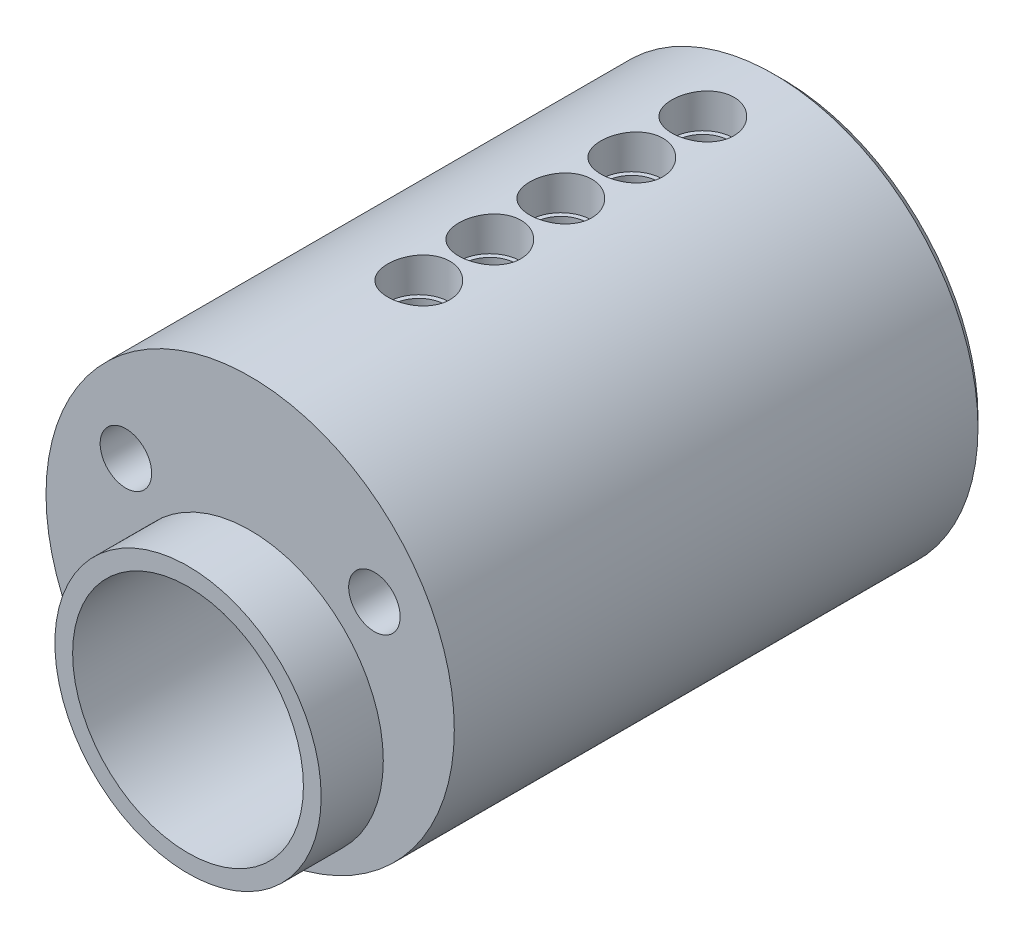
from build123d import *

# Parameters (mm, degrees)
ESQUISSE1_R                  = 11.5
BOSS_EXTRU_1_DEPTH           = 30
ESQUISSE2_R                  = 6.5
ENL_V_MAT_EXTRU_1_DEPTH      = 35.124771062
ESQUISSE3_R                  = 7
ENL_V_MAT_EXTRU_2_DEPTH      = 1
ESQUISSE4_R                  = 7.5
ESQUISSE4_R_2                = 6.5
BOSS_EXTRU_2_DEPTH           = 3.5
ENL_V_MAT_EXTRU_3_REACH      = 44.232
ENL_V_MAT_EXTRU_3_END_RADIUS = 6.5
ESQUISSE7_R                  = 1.5
ESQUISSE8_R                  = 1.75
ENL_V_MAT_EXTRU_4_DEPTH      = 2
CHANFREIN1_SIZE              = 0.5
TROU_TARAUD_M3_5X0_61_D      = 2.9
TROU_TARAUD_M3_5X0_61_DEPTH  = 10
TROU_TARAUD_M3_5X0_61_TIP    = 0.871247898
ENL_V_MAT_EXTRU_6_DEPTH      = 0.01
ESQUISSE15_W                 = 0.179487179
ESQUISSE15_H                 = 2.051282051
ESQUISSE15_H_2               = 2
ENL_V_MAT_EXTRU_7_DEPTH      = 0.01


with BuildPart() as part:
    # Esquisse1 → Boss.-Extru.1 (new body)
    with BuildSketch(Plane.XY):
        Circle(ESQUISSE1_R)
    extrude(amount=BOSS_EXTRU_1_DEPTH)

    # Esquisse2 → Enl_v. mat.-Extru.1 (cut, through all)
    with BuildSketch(Plane(origin=(0, 0, 0), x_dir=(-1, 0, 0), z_dir=(0, 0, -1))):
        with Locations((0, -3.5)):
            Circle(ESQUISSE2_R)
    extrude(amount=-ENL_V_MAT_EXTRU_1_DEPTH, mode=Mode.SUBTRACT)

    # Esquisse3 → Enl_v. mat.-Extru.2 (cut)
    with BuildSketch(Plane(origin=(0, 0, 0), x_dir=(-1, 0, 0), z_dir=(0, 0, -1))):
        with Locations((0, -3.5)):
            Circle(ESQUISSE3_R)
    extrude(amount=-ENL_V_MAT_EXTRU_2_DEPTH, mode=Mode.SUBTRACT)

    # Esquisse4 → Boss.-Extru.2 (add)
    with BuildSketch(Plane.XY.offset(30)):
        with Locations((0, -3.5)):
            Circle(ESQUISSE4_R)
        with Locations(Location((0, -3.5, 0), (0, 0, 180))):
            Circle(ESQUISSE4_R_2, mode=Mode.SUBTRACT)
    extrude(amount=BOSS_EXTRU_2_DEPTH)

    # Enl_v. mat.-Extru.3: up to this cylinder (the profile starts outside it)
    enl_v_mat_extru_3_end = Plane(origin=(0, -3.5, 12.5), z_dir=(0, 0, -1)) * Cylinder(ENL_V_MAT_EXTRU_3_END_RADIUS, 118.464, mode=Mode.PRIVATE)
    # Esquisse7 → Enl_v. mat.-Extru.3 (cut, up to the surface)
    with BuildSketch(Plane(origin=(0, 11.5, 0), x_dir=(-1, 0, 0), z_dir=(0, 1, 0)), mode=Mode.PRIVATE) as enl_v_mat_extru_3_sk1:
        with Locations(Location((0, 4.5, 0), (0, 0, 90))):
            Circle(ESQUISSE7_R)
    enl_v_mat_extru_3_tool1 = extrude(enl_v_mat_extru_3_sk1.sketch, amount=-ENL_V_MAT_EXTRU_3_REACH, mode=Mode.PRIVATE) - enl_v_mat_extru_3_end
    add(enl_v_mat_extru_3_tool1.solids().sort_by_distance((0, 11.5, 4.5))[0], mode=Mode.SUBTRACT)
    # Esquisse7 → Enl_v. mat.-Extru.3 (cut, up to the surface)
    with BuildSketch(Plane(origin=(0, 11.5, 0), x_dir=(-1, 0, 0), z_dir=(0, 1, 0)), mode=Mode.PRIVATE) as enl_v_mat_extru_3_sk2:
        with Locations(Location((0, 8.5, 0), (0, 0, 90))):
            Circle(ESQUISSE7_R)
    enl_v_mat_extru_3_tool2 = extrude(enl_v_mat_extru_3_sk2.sketch, amount=-ENL_V_MAT_EXTRU_3_REACH, mode=Mode.PRIVATE) - enl_v_mat_extru_3_end
    add(enl_v_mat_extru_3_tool2.solids().sort_by_distance((0, 11.5, 8.5))[0], mode=Mode.SUBTRACT)
    # Esquisse7 → Enl_v. mat.-Extru.3 (cut, up to the surface)
    with BuildSketch(Plane(origin=(0, 11.5, 0), x_dir=(-1, 0, 0), z_dir=(0, 1, 0)), mode=Mode.PRIVATE) as enl_v_mat_extru_3_sk3:
        with Locations(Location((0, 12.5, 0), (0, 0, 90))):
            Circle(ESQUISSE7_R)
    enl_v_mat_extru_3_tool3 = extrude(enl_v_mat_extru_3_sk3.sketch, amount=-ENL_V_MAT_EXTRU_3_REACH, mode=Mode.PRIVATE) - enl_v_mat_extru_3_end
    add(enl_v_mat_extru_3_tool3.solids().sort_by_distance((0, 11.5, 12.5))[0], mode=Mode.SUBTRACT)
    # Esquisse7 → Enl_v. mat.-Extru.3 (cut, up to the surface)
    with BuildSketch(Plane(origin=(0, 11.5, 0), x_dir=(-1, 0, 0), z_dir=(0, 1, 0)), mode=Mode.PRIVATE) as enl_v_mat_extru_3_sk4:
        with Locations(Location((0, 16.5, 0), (0, 0, 90))):
            Circle(ESQUISSE7_R)
    enl_v_mat_extru_3_tool4 = extrude(enl_v_mat_extru_3_sk4.sketch, amount=-ENL_V_MAT_EXTRU_3_REACH, mode=Mode.PRIVATE) - enl_v_mat_extru_3_end
    add(enl_v_mat_extru_3_tool4.solids().sort_by_distance((0, 11.5, 16.5))[0], mode=Mode.SUBTRACT)
    # Esquisse7 → Enl_v. mat.-Extru.3 (cut, up to the surface)
    with BuildSketch(Plane(origin=(0, 11.5, 0), x_dir=(-1, 0, 0), z_dir=(0, 1, 0)), mode=Mode.PRIVATE) as enl_v_mat_extru_3_sk5:
        with Locations(Location((0, 20.5, 0), (0, 0, 90))):
            Circle(ESQUISSE7_R)
    enl_v_mat_extru_3_tool5 = extrude(enl_v_mat_extru_3_sk5.sketch, amount=-ENL_V_MAT_EXTRU_3_REACH, mode=Mode.PRIVATE) - enl_v_mat_extru_3_end
    add(enl_v_mat_extru_3_tool5.solids().sort_by_distance((0, 11.5, 20.5))[0], mode=Mode.SUBTRACT)

    # Esquisse8 → Enl_v. mat.-Extru.4 (cut)
    with BuildSketch(Plane(origin=(0, 11.5, 0), x_dir=(-1, 0, 0), z_dir=(0, 1, 0))):
        with Locations(Location((0, 20.5, 0), (0, 0, 90))):
            Circle(ESQUISSE8_R)
        with Locations(Location((0, 16.5, 0), (0, 0, 90))):
            Circle(ESQUISSE8_R)
        with Locations(Location((0, 12.5, 0), (0, 0, 90))):
            Circle(ESQUISSE8_R)
        with Locations(Location((0, 8.5, 0), (0, 0, 90))):
            Circle(ESQUISSE8_R)
        with Locations(Location((0, 4.5, 0), (0, 0, 90))):
            Circle(ESQUISSE8_R)
    extrude(amount=-ENL_V_MAT_EXTRU_4_DEPTH, mode=Mode.SUBTRACT)

    # Chanfrein1
    chanfrein1_edges = [part.edges().sort_by_distance(p)[0] for p in [
        (-11.5, 0, 0),
    ]]
    chamfer(chanfrein1_edges, length=CHANFREIN1_SIZE)

    # Trou taraud_ M3.5x0.61
    with Locations(Plane.XY.offset(30)):
        with Locations((-7, 4), (7, 4), (0, -3.5)):
            Hole(TROU_TARAUD_M3_5X0_61_D / 2, depth=TROU_TARAUD_M3_5X0_61_DEPTH)
            with Locations((0, 0, -(TROU_TARAUD_M3_5X0_61_DEPTH + TROU_TARAUD_M3_5X0_61_TIP / 2))):  # 118° drill point
                Cone(0, TROU_TARAUD_M3_5X0_61_D / 2, TROU_TARAUD_M3_5X0_61_TIP, mode=Mode.SUBTRACT)

    # Esquisse14 → Enl_v. mat.-Extru.6 (cut)
    with BuildSketch(Plane(origin=(-8.163719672, -2.261382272, 0), x_dir=(-1, 0, 0), z_dir=(0, 0, -1))):
        with BuildLine():
            Line((-13.566697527, 5.311729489), (-15.097949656, 6.842981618))
            ThreePointArc((-15.097949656, 6.842981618), (-15.791595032, 8.626687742), (-14.945128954, 10.343151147))
            ThreePointArc((-14.945128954, 10.343151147), (-8.163719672, 12.811382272), (-1.38231039, 10.343151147))
            ThreePointArc((-1.38231039, 10.343151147), (-0.535844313, 8.626687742), (-1.229489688, 6.842981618))
            Line((-1.229489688, 6.842981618), (-2.760741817, 5.311729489))
            ThreePointArc((-2.760741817, 5.311729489), (-3.495476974, 4.954542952), (-4.293920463, 5.127476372))
            ThreePointArc((-4.293920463, 5.127476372), (-8.163719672, 6.211382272), (-12.033518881, 5.127476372))
            ThreePointArc((-12.033518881, 5.127476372), (-12.83196237, 4.954542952), (-13.566697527, 5.311729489))
        make_face()
        with BuildLine():
            Line((-2.937518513, 5.488506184), (-1.406266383, 7.019758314))
            ThreePointArc((-1.406266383, 7.019758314), (-0.785606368, 8.615782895), (-1.543007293, 10.151640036))
            ThreePointArc((-1.543007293, 10.151640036), (-8.163719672, 12.561382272), (-14.784432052, 10.151640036))
            ThreePointArc((-14.784432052, 10.151640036), (-15.541832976, 8.615782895), (-14.921172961, 7.019758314))
            Line((-14.921172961, 7.019758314), (-13.389920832, 5.488506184))
            ThreePointArc((-13.389920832, 5.488506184), (-12.802132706, 5.202756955), (-12.163377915, 5.34110369))
            ThreePointArc((-12.163377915, 5.34110369), (-8.163719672, 6.461382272), (-4.164061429, 5.34110369))
            ThreePointArc((-4.164061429, 5.34110369), (-3.525306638, 5.202756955), (-2.937518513, 5.488506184))
        make_face(mode=Mode.SUBTRACT)
    extrude(amount=-ENL_V_MAT_EXTRU_6_DEPTH, mode=Mode.SUBTRACT)

    # Esquisse15 → Enl_v. mat.-Extru.7 (cut)
    # profile 1 of 16: a face of its own
    with BuildSketch(Plane(origin=(0, 0, 0), x_dir=(-1, 0, 0), z_dir=(0, 0, -1))):
        with BuildLine():
            Line((-2.012820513, 8.779246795), (-2.134615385, 8.653846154))
            add(Edge.make_bspline(
                [(-2.134615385, 8.653846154), (-2.145124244, 8.666025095), (-2.165384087, 8.689504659), (-2.197516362, 8.720897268), (-2.22952985, 8.747261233), (-2.260986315, 8.769519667), (-2.292676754, 8.786347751), (-2.324229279, 8.798630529), (-2.355676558, 8.806231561), (-2.376697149, 8.80721124), (-2.387019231, 8.807692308)],
                knots=[0, 0, 0, 0, 1.26578478, 2.440284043, 3.530471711, 4.527705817, 5.468200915, 6.346673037, 7.188140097, 8, 8, 8, 8], degree=3))
            add(Edge.make_bspline(
                [(-2.387019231, 8.807692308), (-2.399670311, 8.807078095), (-2.424565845, 8.80586941), (-2.460237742, 8.793804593), (-2.493352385, 8.775285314), (-2.522013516, 8.749017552), (-2.54629219, 8.718866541), (-2.564014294, 8.685154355), (-2.574851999, 8.64889833), (-2.576226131, 8.623738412), (-2.576923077, 8.610977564)],
                knots=[0, 0, 0, 0, 0.99966794, 1.967205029, 2.953328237, 3.988086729, 5.028030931, 6.008226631, 6.989793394, 8, 8, 8, 8], degree=3))
            add(Edge.make_bspline(
                [(-2.576923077, 8.610977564), (-2.576288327, 8.599427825), (-2.575020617, 8.576360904), (-2.565165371, 8.542333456), (-2.549470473, 8.509158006), (-2.534801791, 8.488836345), (-2.52724359, 8.478365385)],
                knots=[0, 0, 0, 0, 0.960159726, 1.917612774, 2.927026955, 4, 4, 4, 4], degree=3))
            add(Edge.make_bspline(
                [(-2.52724359, 8.478365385), (-2.522693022, 8.472774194), (-2.513007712, 8.460874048), (-2.494831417, 8.44435756), (-2.47424713, 8.426104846), (-2.44949288, 8.407855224), (-2.42163515, 8.388637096), (-2.390069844, 8.369207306), (-2.355798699, 8.348084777), (-2.331263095, 8.334687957), (-2.318509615, 8.327724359)],
                knots=[0, 0, 0, 0, 0.66740084, 1.420478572, 2.27185888, 3.217733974, 4.268547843, 5.408967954, 6.65319498, 8, 8, 8, 8], degree=3))
            add(Edge.make_bspline(
                [(-2.318509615, 8.327724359), (-2.302959, 8.319012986), (-2.272920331, 8.302185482), (-2.23023875, 8.276065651), (-2.191503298, 8.250104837), (-2.156385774, 8.224580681), (-2.125561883, 8.198779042), (-2.098096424, 8.173688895), (-2.074674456, 8.148552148), (-2.061557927, 8.130990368), (-2.055288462, 8.122596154)],
                knots=[0, 0, 0, 0, 1.27191281, 2.456916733, 3.569705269, 4.599008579, 5.553216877, 6.436649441, 7.252746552, 8, 8, 8, 8], degree=3))
            add(Edge.make_bspline(
                [(-2.055288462, 8.122596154), (-2.044882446, 8.105644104), (-2.024172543, 8.071906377), (-2.002424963, 8.01635299), (-1.989819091, 7.957432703), (-1.988069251, 7.917128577), (-1.987179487, 7.896634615)],
                knots=[0, 0, 0, 0, 0.995354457, 1.980940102, 2.973342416, 4, 4, 4, 4], degree=3))
            add(Edge.make_bspline(
                [(-1.987179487, 7.896634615), (-1.987590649, 7.882195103), (-1.988400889, 7.853740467), (-1.99403407, 7.81183485), (-2.003722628, 7.77175796), (-2.016919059, 7.73307494), (-2.034738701, 7.696526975), (-2.055623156, 7.661191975), (-2.080694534, 7.627834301), (-2.109318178, 7.596497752), (-2.14065846, 7.567877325), (-2.174090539, 7.54272078), (-2.209655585, 7.521821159), (-2.247099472, 7.504526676), (-2.286507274, 7.490773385), (-2.327885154, 7.481251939), (-2.371101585, 7.475553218), (-2.400490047, 7.474762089), (-2.415464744, 7.474358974)],
                knots=[0, 0, 0, 0, 1.032770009, 2.035186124, 3.017557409, 3.978232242, 4.952395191, 5.920591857, 6.910227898, 7.931268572, 8.952309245, 9.941945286, 10.918353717, 11.897095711, 12.887975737, 13.898235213, 14.929059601, 16, 16, 16, 16], degree=3))
            add(Edge.make_bspline(
                [(-2.415464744, 7.474358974), (-2.435674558, 7.474926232), (-2.475813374, 7.476052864), (-2.535178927, 7.486627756), (-2.593190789, 7.503082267), (-2.649409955, 7.525777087), (-2.702579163, 7.554434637), (-2.751225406, 7.588756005), (-2.79551767, 7.627607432), (-2.820728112, 7.657386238), (-2.833333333, 7.672275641)],
                knots=[0, 0, 0, 0, 1.013940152, 2.01379169, 3.017749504, 4.037548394, 5.051665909, 6.043208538, 7.021604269, 8, 8, 8, 8], degree=3))
            Line((-2.833333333, 7.672275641), (-2.714342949, 7.807692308))
            add(Edge.make_bspline(
                [(-2.714342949, 7.807692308), (-2.703044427, 7.795489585), (-2.681140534, 7.771832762), (-2.646111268, 7.740333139), (-2.610465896, 7.713932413), (-2.57456036, 7.691850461), (-2.537863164, 7.674835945), (-2.500579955, 7.662882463), (-2.46278657, 7.655200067), (-2.437402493, 7.654298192), (-2.424679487, 7.653846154)],
                knots=[0, 0, 0, 0, 1.179806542, 2.287233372, 3.337373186, 4.324005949, 5.273901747, 6.200048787, 7.097828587, 8, 8, 8, 8], degree=3))
            add(Edge.make_bspline(
                [(-2.424679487, 7.653846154), (-2.407354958, 7.654629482), (-2.373505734, 7.656159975), (-2.325023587, 7.670055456), (-2.280258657, 7.691844), (-2.241388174, 7.722749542), (-2.208301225, 7.758724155), (-2.184342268, 7.799246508), (-2.169327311, 7.843127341), (-2.167563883, 7.8735458), (-2.166666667, 7.889022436)],
                knots=[0, 0, 0, 0, 1.072336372, 2.095165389, 3.102688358, 4.141489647, 5.156069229, 6.117746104, 7.042326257, 8, 8, 8, 8], degree=3))
            add(Edge.make_bspline(
                [(-2.166666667, 7.889022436), (-2.167287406, 7.901770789), (-2.168512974, 7.926940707), (-2.1781377, 7.963369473), (-2.193345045, 7.997923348), (-2.208319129, 8.018146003), (-2.215945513, 8.028445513)],
                knots=[0, 0, 0, 0, 1.013901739, 2.00181326, 2.98231254, 4, 4, 4, 4], degree=3))
            add(Edge.make_bspline(
                [(-2.215945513, 8.028445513), (-2.220529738, 8.033608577), (-2.230515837, 8.044855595), (-2.248833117, 8.061098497), (-2.27076561, 8.078605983), (-2.296559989, 8.097081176), (-2.326268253, 8.116280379), (-2.36001081, 8.136102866), (-2.397325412, 8.157490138), (-2.42370863, 8.171672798), (-2.4375, 8.179086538)],
                knots=[0, 0, 0, 0, 0.615000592, 1.339693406, 2.178160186, 3.116406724, 4.166410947, 5.330106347, 6.604359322, 8, 8, 8, 8], degree=3))
            add(Edge.make_bspline(
                [(-2.4375, 8.179086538), (-2.452383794, 8.187394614), (-2.481248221, 8.203506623), (-2.522132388, 8.228601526), (-2.55901659, 8.254125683), (-2.592788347, 8.278647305), (-2.622594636, 8.303459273), (-2.648318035, 8.328589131), (-2.670971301, 8.353023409), (-2.683512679, 8.37033615), (-2.689503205, 8.378605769)],
                knots=[0, 0, 0, 0, 1.262093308, 2.447601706, 3.550203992, 4.582594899, 5.537233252, 6.418365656, 7.244515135, 8, 8, 8, 8], degree=3))
            add(Edge.make_bspline(
                [(-2.689503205, 8.378605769), (-2.699863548, 8.395260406), (-2.720587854, 8.428575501), (-2.74071082, 8.484181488), (-2.754542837, 8.54272152), (-2.755778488, 8.583114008), (-2.756410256, 8.603766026)],
                knots=[0, 0, 0, 0, 0.985009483, 1.970363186, 2.962279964, 4, 4, 4, 4], degree=3))
            add(Edge.make_bspline(
                [(-2.756410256, 8.603766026), (-2.756105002, 8.617266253), (-2.755507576, 8.643688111), (-2.750739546, 8.682510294), (-2.742058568, 8.719394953), (-2.731170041, 8.754896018), (-2.716036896, 8.788325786), (-2.697953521, 8.820130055), (-2.676703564, 8.850264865), (-2.652221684, 8.878266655), (-2.625303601, 8.903700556), (-2.596220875, 8.9258712), (-2.565627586, 8.944789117), (-2.533394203, 8.960654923), (-2.499211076, 8.972655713), (-2.463317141, 8.980917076), (-2.425785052, 8.986434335), (-2.400127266, 8.986927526), (-2.387019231, 8.987179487)],
                knots=[0, 0, 0, 0, 1.087655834, 2.128696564, 3.144119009, 4.137814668, 5.115653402, 6.093965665, 7.082169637, 8.081268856, 9.086088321, 10.061021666, 11.022561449, 11.980240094, 12.950172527, 13.934149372, 14.944599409, 16, 16, 16, 16], degree=3))
            add(Edge.make_bspline(
                [(-2.387019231, 8.987179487), (-2.371480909, 8.986548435), (-2.340112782, 8.985274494), (-2.293052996, 8.975156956), (-2.246062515, 8.958509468), (-2.1990206, 8.935517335), (-2.152271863, 8.905764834), (-2.105405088, 8.869805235), (-2.057857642, 8.827875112), (-2.028168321, 8.795818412), (-2.012820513, 8.779246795)],
                knots=[0, 0, 0, 0, 0.845714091, 1.707292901, 2.609013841, 3.555613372, 4.552488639, 5.621697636, 6.770543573, 8, 8, 8, 8], degree=3))
        make_face()
    # profile 2 of 16: a face of its own
    with BuildSketch(Plane(origin=(0, 0, 0), x_dir=(-1, 0, 0), z_dir=(0, 0, -1))):
        Polygon((-1.448717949, 9.551282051), (-1.269230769, 9.551282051), (-1.269230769, 8.961538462), (-1.012820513, 8.961538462), (-1.012820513, 8.782051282), (-1.269230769, 8.782051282), (-1.269230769, 7.5), (-1.448717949, 7.5), (-1.448717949, 8.782051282), (-1.705128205, 8.782051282), (-1.705128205, 8.961538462), (-1.448717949, 8.961538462), align=None)
    # profile 3 of 16: a face of its own
    with BuildSketch(Plane(origin=(0, 0, 0), x_dir=(-1, 0, 0), z_dir=(0, 0, -1))):
        Polygon((-0.858974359, 8.961538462), (-0.665464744, 8.961538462), (-0.170673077, 7.842147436), (0.331730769, 8.961538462), (0.525641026, 8.961538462), (-0.371794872, 6.961538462), (-0.565705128, 6.961538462), (-0.268028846, 7.624599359), align=None)
    # profile 4 of 16: a face of its own
    with BuildSketch(Plane(origin=(0, 0, 0), x_dir=(-1, 0, 0), z_dir=(0, 0, -1))):
        with Locations((0.820512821, 8.525641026)):
            Rectangle(ESQUISSE15_W, ESQUISSE15_H)
    # profile 5 of 16: a face of its own
    with BuildSketch(Plane(origin=(0, 0, 0), x_dir=(-1, 0, 0), z_dir=(0, 0, -1))):
        with BuildLine():
            Line((2.520032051, 7.961538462), (2.679487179, 7.877804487))
            add(Edge.make_bspline(
                [(2.679487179, 7.877804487), (2.666780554, 7.855265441), (2.642058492, 7.811413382), (2.599543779, 7.751166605), (2.55497688, 7.69696791), (2.506346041, 7.65026525), (2.455106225, 7.609550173), (2.400973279, 7.573928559), (2.343665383, 7.543575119), (2.283179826, 7.518002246), (2.219008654, 7.498339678), (2.150996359, 7.484451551), (2.079012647, 7.475866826), (2.029671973, 7.474869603), (2.004407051, 7.474358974)],
                knots=[0, 0, 0, 0, 1.120438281, 2.179929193, 3.190490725, 4.156257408, 5.095198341, 6.022838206, 6.959905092, 7.901321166, 8.864066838, 9.862729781, 10.905609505, 12, 12, 12, 12], degree=3))
            add(Edge.make_bspline(
                [(2.004407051, 7.474358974), (1.976325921, 7.475014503), (1.921547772, 7.47629325), (1.841810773, 7.487317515), (1.76673682, 7.50530172), (1.696330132, 7.530424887), (1.630763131, 7.563240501), (1.5699055, 7.603217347), (1.513437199, 7.650150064), (1.463137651, 7.704445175), (1.417855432, 7.76254915), (1.377897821, 7.82309537), (1.344493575, 7.885931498), (1.317320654, 7.950657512), (1.295375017, 8.016865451), (1.280079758, 8.085157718), (1.271262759, 8.155349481), (1.269911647, 8.202833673), (1.269230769, 8.226762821)],
                knots=[0, 0, 0, 0, 1.145258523, 2.234067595, 3.276747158, 4.290159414, 5.277019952, 6.260822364, 7.254936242, 8.264827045, 9.274100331, 10.257902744, 11.220704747, 12.172965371, 13.118907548, 14.062713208, 15.023725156, 16, 16, 16, 16], degree=3))
            add(Edge.make_bspline(
                [(1.269230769, 8.226762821), (1.269835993, 8.249217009), (1.271035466, 8.293718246), (1.278595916, 8.359584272), (1.291994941, 8.42360053), (1.310381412, 8.485820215), (1.334124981, 8.546139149), (1.363171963, 8.604594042), (1.397567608, 8.661122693), (1.424123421, 8.696781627), (1.4375, 8.71474359)],
                knots=[0, 0, 0, 0, 1.024358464, 2.0301432, 3.019427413, 4.004406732, 4.986367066, 5.972626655, 6.978780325, 8, 8, 8, 8], degree=3))
            add(Edge.make_bspline(
                [(1.4375, 8.71474359), (1.455618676, 8.736382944), (1.491282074, 8.778976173), (1.551599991, 8.83494093), (1.616914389, 8.881823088), (1.686406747, 8.920684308), (1.760884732, 8.950212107), (1.839347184, 8.972216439), (1.922687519, 8.984546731), (1.979661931, 8.986288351), (2.008814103, 8.987179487)],
                knots=[0, 0, 0, 0, 1.030682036, 2.02871468, 2.997146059, 3.962720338, 4.930598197, 5.918074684, 6.934738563, 8, 8, 8, 8], degree=3))
            add(Edge.make_bspline(
                [(2.008814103, 8.987179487), (2.038784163, 8.986405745), (2.097578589, 8.984887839), (2.18331123, 8.970815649), (2.264431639, 8.948499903), (2.340907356, 8.916983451), (2.412746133, 8.87632085), (2.479481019, 8.825954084), (2.542253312, 8.767429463), (2.5787725, 8.722421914), (2.597355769, 8.699519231)],
                knots=[0, 0, 0, 0, 1.056321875, 2.072262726, 3.055038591, 4.01806755, 4.982017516, 5.957941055, 6.960871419, 8, 8, 8, 8], degree=3))
            add(Edge.make_bspline(
                [(2.597355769, 8.699519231), (2.609999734, 8.682260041), (2.635203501, 8.647856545), (2.666773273, 8.591758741), (2.694177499, 8.533066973), (2.716082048, 8.470832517), (2.733818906, 8.405792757), (2.746651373, 8.337482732), (2.75417687, 8.265922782), (2.755656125, 8.217164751), (2.756410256, 8.192307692)],
                knots=[0, 0, 0, 0, 0.94817472, 1.890038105, 2.849395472, 3.817997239, 4.812318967, 5.836947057, 6.897266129, 8, 8, 8, 8], degree=3))
            Line((2.756410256, 8.192307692), (1.448717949, 8.192307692))
            add(Edge.make_bspline(
                [(1.448717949, 8.192307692), (1.449597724, 8.173050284), (1.451327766, 8.135181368), (1.459393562, 8.079769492), (1.472107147, 8.026984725), (1.489975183, 7.977222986), (1.51161338, 7.929834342), (1.538119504, 7.885170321), (1.569742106, 7.843434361), (1.605013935, 7.80425314), (1.644275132, 7.769361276), (1.685579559, 7.73813169), (1.729518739, 7.711957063), (1.775746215, 7.690711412), (1.824187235, 7.674079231), (1.874857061, 7.662726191), (1.927655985, 7.65512213), (1.963647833, 7.654276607), (1.981971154, 7.653846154)],
                knots=[0, 0, 0, 0, 1.094153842, 2.151609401, 3.174256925, 4.172055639, 5.149267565, 6.128595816, 7.11444997, 8.118368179, 9.117203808, 10.09244225, 11.054858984, 12.015122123, 12.976791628, 13.957293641, 14.960065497, 16, 16, 16, 16], degree=3))
            add(Edge.make_bspline(
                [(1.981971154, 7.653846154), (1.999886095, 7.654193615), (2.035432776, 7.654883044), (2.088370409, 7.661586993), (2.140450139, 7.672427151), (2.191456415, 7.687221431), (2.240354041, 7.705265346), (2.285637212, 7.727038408), (2.32728305, 7.751123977), (2.366207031, 7.778672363), (2.403961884, 7.812391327), (2.441414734, 7.854468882), (2.481572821, 7.904233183), (2.506709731, 7.94168785), (2.520032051, 7.961538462)],
                knots=[0, 0, 0, 0, 0.99110716, 1.966546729, 2.947904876, 3.932708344, 4.903319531, 5.828989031, 6.710028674, 7.56322171, 8.463672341, 9.504779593, 10.677557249, 12, 12, 12, 12], degree=3))
        make_face()
        with BuildLine():
            add(Edge.make_bspline(
                [(2.576923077, 8.371794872), (2.570353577, 8.395602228), (2.557709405, 8.441423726), (2.531288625, 8.504875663), (2.501533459, 8.561268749), (2.466321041, 8.610171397), (2.426424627, 8.653601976), (2.380341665, 8.691555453), (2.328664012, 8.725508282), (2.271658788, 8.754166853), (2.211292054, 8.778561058), (2.148088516, 8.794918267), (2.083598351, 8.80612372), (2.039978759, 8.80716721), (2.018028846, 8.807692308)],
                knots=[0, 0, 0, 0, 1.154881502, 2.222775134, 3.210006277, 4.132804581, 5.035138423, 5.962687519, 6.919655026, 7.923214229, 8.944639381, 9.960483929, 10.97369054, 12, 12, 12, 12], degree=3))
            add(Edge.make_bspline(
                [(2.018028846, 8.807692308), (2.000114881, 8.807342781), (1.964702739, 8.80665184), (1.9125307, 8.800097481), (1.862428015, 8.789263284), (1.814024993, 8.774426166), (1.767955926, 8.754649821), (1.723273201, 8.731459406), (1.681112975, 8.70314993), (1.65474652, 8.681573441), (1.641426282, 8.670673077)],
                knots=[0, 0, 0, 0, 1.04873581, 2.073130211, 3.073294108, 4.04793562, 5.032784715, 6.005352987, 6.992311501, 8, 8, 8, 8], degree=3))
            add(Edge.make_bspline(
                [(1.641426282, 8.670673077), (1.631887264, 8.662047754), (1.612582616, 8.644592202), (1.586788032, 8.614518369), (1.562090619, 8.582088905), (1.539614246, 8.54606312), (1.518998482, 8.506851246), (1.499707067, 8.464784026), (1.482343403, 8.419542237), (1.472574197, 8.388015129), (1.467548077, 8.371794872)],
                knots=[0, 0, 0, 0, 0.879870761, 1.780643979, 2.707998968, 3.669668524, 4.684282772, 5.740141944, 6.837334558, 8, 8, 8, 8], degree=3))
            Line((1.467548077, 8.371794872), (2.576923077, 8.371794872))
        make_face(mode=Mode.SUBTRACT)
    # profile 6 of 16: a face of its own
    with BuildSketch(Plane(origin=(0, 0, 0), x_dir=(-1, 0, 0), z_dir=(0, 0, -1))):
        Polygon((-5.707532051, 5.935897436), (-5.83213141, 5.935897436), (-5.858974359, 6.551282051), (-5.679487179, 6.551282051), align=None)
    # profile 7 of 16: a face of its own
    with BuildSketch(Plane(origin=(0, 0, 0), x_dir=(-1, 0, 0), z_dir=(0, 0, -1))):
        Polygon((-6.244791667, 5.935897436), (-6.370592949, 5.935897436), (-6.397435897, 6.551282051), (-6.217948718, 6.551282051), align=None)
    # profile 8 of 16: a face of its own
    with BuildSketch(Plane(origin=(0, 0, 0), x_dir=(-1, 0, 0), z_dir=(0, 0, -1))):
        Polygon((-5.602564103, 6.294871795), (-5.602564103, 6.5), (-4.551282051, 6.5), (-4.551282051, 6.294871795), (-4.987179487, 6.294871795), (-4.987179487, 4.5), (-5.166666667, 4.5), (-5.166666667, 6.294871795), align=None)
    # profile 9 of 16: a face of its own
    with BuildSketch(Plane(origin=(0, 0, 0), x_dir=(-1, 0, 0), z_dir=(0, 0, -1))):
        Polygon((-4.243589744, 6.5), (-4.064102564, 6.5), (-4.064102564, 5.679487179), (-3.038461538, 5.679487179), (-3.038461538, 6.5), (-2.858974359, 6.5), (-2.858974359, 4.5), (-3.038461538, 4.5), (-3.038461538, 5.474358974), (-4.064102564, 5.474358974), (-4.064102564, 4.5), (-4.243589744, 4.5), align=None)
    # profile 10 of 16: a face of its own
    with BuildSketch(Plane(origin=(0, 0, 0), x_dir=(-1, 0, 0), z_dir=(0, 0, -1))):
        with Locations((-2.256410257, 5.5)):
            Rectangle(ESQUISSE15_W, ESQUISSE15_H_2)
    # profile 11 of 16: a face of its own
    with BuildSketch(Plane(origin=(0, 0, 0), x_dir=(-1, 0, 0), z_dir=(0, 0, -1))):
        with BuildLine():
            Line((-1.653846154, 6.5), (-1.253605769, 6.5))
            add(Edge.make_bspline(
                [(-1.253605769, 6.5), (-1.226896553, 6.499911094), (-1.175611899, 6.499740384), (-1.102141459, 6.498788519), (-1.035383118, 6.496060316), (-0.975371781, 6.493712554), (-0.922108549, 6.489431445), (-0.875430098, 6.485339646), (-0.835551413, 6.479983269), (-0.811410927, 6.475008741), (-0.800480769, 6.47275641)],
                knots=[0, 0, 0, 0, 1.410062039, 2.707475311, 3.878576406, 4.937260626, 5.877586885, 6.699081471, 7.410979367, 8, 8, 8, 8], degree=3))
            add(Edge.make_bspline(
                [(-0.800480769, 6.47275641), (-0.785848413, 6.469141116), (-0.756895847, 6.461987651), (-0.715210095, 6.446867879), (-0.675487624, 6.429370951), (-0.637893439, 6.408820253), (-0.602615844, 6.385063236), (-0.569291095, 6.358510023), (-0.537767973, 6.329305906), (-0.509321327, 6.296714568), (-0.482499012, 6.262522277), (-0.45987694, 6.225548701), (-0.440376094, 6.186884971), (-0.424850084, 6.146137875), (-0.412348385, 6.103702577), (-0.403533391, 6.059194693), (-0.398246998, 6.012816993), (-0.397708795, 5.981183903), (-0.397435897, 5.965144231)],
                knots=[0, 0, 0, 0, 1.027469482, 2.033020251, 3.019912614, 3.986113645, 4.951240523, 5.91722682, 6.890402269, 7.87763091, 8.8651537, 9.85103654, 10.82876324, 11.815024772, 12.821070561, 13.842952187, 14.906261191, 16, 16, 16, 16], degree=3))
            add(Edge.make_bspline(
                [(-0.397435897, 5.965144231), (-0.398275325, 5.9384956), (-0.399913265, 5.886497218), (-0.415184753, 5.811033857), (-0.440199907, 5.740639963), (-0.474670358, 5.67540417), (-0.518567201, 5.616598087), (-0.571324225, 5.564946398), (-0.63297086, 5.521723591), (-0.690359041, 5.49175056), (-0.741052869, 5.472554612), (-0.782786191, 5.459048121), (-0.828310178, 5.448612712), (-0.877188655, 5.439264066), (-0.929625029, 5.432205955), (-0.985493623, 5.427036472), (-1.044834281, 5.423805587), (-1.085599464, 5.423324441), (-1.106570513, 5.423076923)],
                knots=[0, 0, 0, 0, 1.260483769, 2.459530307, 3.627416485, 4.787058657, 5.939039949, 7.08810263, 8.267026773, 9.491475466, 10.141966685, 10.831826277, 11.566392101, 12.351337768, 13.187381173, 14.07005841, 15.007169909, 16, 16, 16, 16], degree=3))
            Line((-1.106570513, 5.423076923), (-0.371794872, 4.5))
            Line((-0.371794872, 4.5), (-0.59375, 4.5))
            Line((-0.59375, 4.5), (-1.328525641, 5.423076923))
            Line((-1.328525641, 5.423076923), (-1.474358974, 5.423076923))
            Line((-1.474358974, 5.423076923), (-1.474358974, 4.5))
            Line((-1.474358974, 4.5), (-1.653846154, 4.5))
            Line((-1.653846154, 4.5), (-1.653846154, 6.5))
        make_face()
        with BuildLine():
            Line((-1.474358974, 6.294871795), (-1.474358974, 5.628205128))
            Line((-1.474358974, 5.628205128), (-1.108173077, 5.625400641))
            add(Edge.make_bspline(
                [(-1.108173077, 5.625400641), (-1.091075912, 5.625393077), (-1.057936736, 5.625378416), (-1.009993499, 5.627660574), (-0.965353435, 5.630256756), (-0.924187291, 5.634227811), (-0.886476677, 5.639345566), (-0.852240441, 5.645747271), (-0.821422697, 5.653205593), (-0.785480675, 5.664749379), (-0.745345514, 5.683038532), (-0.701727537, 5.709647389), (-0.664583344, 5.743115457), (-0.633201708, 5.781386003), (-0.60798489, 5.82346386), (-0.590206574, 5.868844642), (-0.578925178, 5.916382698), (-0.577594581, 5.949055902), (-0.576923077, 5.965544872)],
                knots=[0, 0, 0, 0, 1.146690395, 2.22261258, 3.21895312, 4.145990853, 4.996080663, 5.770904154, 6.481378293, 7.121626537, 8.300444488, 9.431385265, 10.535395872, 11.636531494, 12.74115979, 13.810798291, 14.895190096, 16, 16, 16, 16], degree=3))
            add(Edge.make_bspline(
                [(-0.576923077, 5.965544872), (-0.577610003, 5.981628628), (-0.578971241, 6.013500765), (-0.590084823, 6.060161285), (-0.608878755, 6.104199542), (-0.634205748, 6.145436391), (-0.665062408, 6.18286824), (-0.701244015, 6.214895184), (-0.74176127, 6.24132345), (-0.779630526, 6.258211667), (-0.813478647, 6.268565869), (-0.842867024, 6.275852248), (-0.876073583, 6.281706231), (-0.913259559, 6.286396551), (-0.954266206, 6.290427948), (-0.999300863, 6.29314325), (-1.048064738, 6.294751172), (-1.081862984, 6.294830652), (-1.099358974, 6.294871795)],
                knots=[0, 0, 0, 0, 1.101028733, 2.181837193, 3.264309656, 4.369019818, 5.486613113, 6.575447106, 7.666700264, 8.788928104, 9.402425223, 10.0903467, 10.862060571, 11.710948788, 12.657782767, 13.684531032, 14.801375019, 16, 16, 16, 16], degree=3))
            Line((-1.099358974, 6.294871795), (-1.474358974, 6.294871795))
        make_face(mode=Mode.SUBTRACT)
    # profile 12 of 16: a face of its own
    with BuildSketch(Plane(origin=(0, 0, 0), x_dir=(-1, 0, 0), z_dir=(0, 0, -1))):
        Polygon((0.858974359, 6.5), (1.782051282, 4.5), (1.586939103, 4.5), (1.291266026, 5.141025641), (0.384615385, 5.141025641), (0.080528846, 4.5), (-0.115384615, 4.5), (0.833333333, 6.5), align=None)
        Polygon((0.844150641, 6.110176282), (0.481971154, 5.346153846), (1.196714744, 5.346153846), align=None, mode=Mode.SUBTRACT)
    # profile 13 of 16: a face of its own
    with BuildSketch(Plane(origin=(0, 0, 0), x_dir=(-1, 0, 0), z_dir=(0, 0, -1))):
        with BuildLine():
            Line((2.141025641, 6.5), (2.541266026, 6.5))
            add(Edge.make_bspline(
                [(2.541266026, 6.5), (2.567975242, 6.499911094), (2.619259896, 6.499740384), (2.692730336, 6.498788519), (2.759488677, 6.496060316), (2.819500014, 6.493712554), (2.872763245, 6.489431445), (2.919441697, 6.485339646), (2.959320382, 6.479983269), (2.983460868, 6.475008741), (2.994391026, 6.47275641)],
                knots=[0, 0, 0, 0, 1.410062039, 2.707475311, 3.878576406, 4.937260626, 5.877586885, 6.699081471, 7.410979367, 8, 8, 8, 8], degree=3))
            add(Edge.make_bspline(
                [(2.994391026, 6.47275641), (3.009023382, 6.469141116), (3.037975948, 6.461987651), (3.0796617, 6.446867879), (3.119384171, 6.429370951), (3.156978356, 6.408820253), (3.192255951, 6.385063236), (3.2255807, 6.358510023), (3.257103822, 6.329305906), (3.285550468, 6.296714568), (3.312372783, 6.262522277), (3.334994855, 6.225548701), (3.354495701, 6.186884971), (3.37002171, 6.146137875), (3.38252341, 6.103702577), (3.391338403, 6.059194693), (3.396624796, 6.012816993), (3.397163, 5.981183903), (3.397435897, 5.965144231)],
                knots=[0, 0, 0, 0, 1.027469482, 2.033020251, 3.019912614, 3.986113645, 4.951240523, 5.91722682, 6.890402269, 7.87763091, 8.8651537, 9.85103654, 10.82876324, 11.815024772, 12.821070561, 13.842952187, 14.906261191, 16, 16, 16, 16], degree=3))
            add(Edge.make_bspline(
                [(3.397435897, 5.965144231), (3.39659647, 5.9384956), (3.394958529, 5.886497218), (3.379687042, 5.811033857), (3.354671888, 5.740639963), (3.320201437, 5.67540417), (3.276304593, 5.616598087), (3.22354757, 5.564946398), (3.161900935, 5.521723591), (3.104512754, 5.49175056), (3.053818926, 5.472554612), (3.012085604, 5.459048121), (2.966561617, 5.448612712), (2.91768314, 5.439264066), (2.865246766, 5.432205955), (2.809378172, 5.427036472), (2.750037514, 5.423805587), (2.709272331, 5.423324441), (2.688301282, 5.423076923)],
                knots=[0, 0, 0, 0, 1.260483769, 2.459530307, 3.627416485, 4.787058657, 5.939039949, 7.08810263, 8.267026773, 9.491475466, 10.141966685, 10.831826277, 11.566392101, 12.351337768, 13.187381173, 14.07005841, 15.007169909, 16, 16, 16, 16], degree=3))
            Line((2.688301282, 5.423076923), (3.423076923, 4.5))
            Line((3.423076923, 4.5), (3.201121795, 4.5))
            Line((3.201121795, 4.5), (2.466346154, 5.423076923))
            Line((2.466346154, 5.423076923), (2.320512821, 5.423076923))
            Line((2.320512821, 5.423076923), (2.320512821, 4.5))
            Line((2.320512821, 4.5), (2.141025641, 4.5))
            Line((2.141025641, 4.5), (2.141025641, 6.5))
        make_face()
        with BuildLine():
            Line((2.320512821, 6.294871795), (2.320512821, 5.628205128))
            Line((2.320512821, 5.628205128), (2.686698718, 5.625400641))
            add(Edge.make_bspline(
                [(2.686698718, 5.625400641), (2.703795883, 5.625393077), (2.736935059, 5.625378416), (2.784878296, 5.627660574), (2.829518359, 5.630256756), (2.870684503, 5.634227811), (2.908395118, 5.639345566), (2.942631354, 5.645747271), (2.973449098, 5.653205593), (3.00939112, 5.664749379), (3.049526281, 5.683038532), (3.093144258, 5.709647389), (3.130288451, 5.743115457), (3.161670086, 5.781386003), (3.186886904, 5.82346386), (3.204665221, 5.868844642), (3.215946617, 5.916382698), (3.217277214, 5.949055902), (3.217948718, 5.965544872)],
                knots=[0, 0, 0, 0, 1.146690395, 2.22261258, 3.21895312, 4.145990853, 4.996080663, 5.770904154, 6.481378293, 7.121626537, 8.300444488, 9.431385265, 10.535395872, 11.636531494, 12.74115979, 13.810798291, 14.895190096, 16, 16, 16, 16], degree=3))
            add(Edge.make_bspline(
                [(3.217948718, 5.965544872), (3.217261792, 5.981628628), (3.215900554, 6.013500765), (3.204786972, 6.060161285), (3.18599304, 6.104199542), (3.160666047, 6.145436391), (3.129809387, 6.18286824), (3.09362778, 6.214895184), (3.053110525, 6.24132345), (3.015241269, 6.258211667), (2.981393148, 6.268565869), (2.952004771, 6.275852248), (2.918798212, 6.281706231), (2.881612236, 6.286396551), (2.840605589, 6.290427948), (2.795570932, 6.29314325), (2.746807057, 6.294751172), (2.713008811, 6.294830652), (2.695512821, 6.294871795)],
                knots=[0, 0, 0, 0, 1.101028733, 2.181837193, 3.264309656, 4.369019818, 5.486613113, 6.575447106, 7.666700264, 8.788928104, 9.402425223, 10.0903467, 10.862060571, 11.710948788, 12.657782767, 13.684531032, 14.801375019, 16, 16, 16, 16], degree=3))
            Line((2.695512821, 6.294871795), (2.320512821, 6.294871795))
        make_face(mode=Mode.SUBTRACT)
    # profile 14 of 16: a face of its own
    with BuildSketch(Plane(origin=(0, 0, 0), x_dir=(-1, 0, 0), z_dir=(0, 0, -1))):
        with BuildLine():
            Line((3.833333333, 4.5), (3.833333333, 6.5))
            Line((3.833333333, 6.5), (4.237179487, 6.5))
            add(Edge.make_bspline(
                [(4.237179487, 6.5), (4.272304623, 6.499747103), (4.340166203, 6.499258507), (4.438230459, 6.496160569), (4.528964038, 6.490680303), (4.612068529, 6.482697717), (4.687772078, 6.472895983), (4.755862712, 6.460610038), (4.816692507, 6.446102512), (4.854103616, 6.433733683), (4.871794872, 6.427884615)],
                knots=[0, 0, 0, 0, 1.314313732, 2.53924729, 3.670748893, 4.714932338, 5.66265055, 6.526160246, 7.303039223, 8, 8, 8, 8], degree=3))
            add(Edge.make_bspline(
                [(4.871794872, 6.427884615), (4.894934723, 6.419067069), (4.94068969, 6.40163193), (5.005836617, 6.368742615), (5.067165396, 6.331477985), (5.125004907, 6.289788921), (5.178033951, 6.242495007), (5.228324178, 6.191605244), (5.273818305, 6.13526905), (5.315480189, 6.074654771), (5.353043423, 6.010476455), (5.38569437, 5.942856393), (5.412810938, 5.872137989), (5.435321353, 5.798517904), (5.453062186, 5.72183426), (5.465166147, 5.641997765), (5.47314957, 5.559323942), (5.473951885, 5.503224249), (5.474358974, 5.474759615)],
                knots=[0, 0, 0, 0, 0.984719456, 1.947108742, 2.898477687, 3.838006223, 4.779231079, 5.722358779, 6.681677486, 7.655904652, 8.64651281, 9.637519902, 10.640069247, 11.656948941, 12.698408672, 13.768548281, 14.867775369, 16, 16, 16, 16], degree=3))
            add(Edge.make_bspline(
                [(5.474358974, 5.474759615), (5.473999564, 5.450038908), (5.473291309, 5.401324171), (5.4669317, 5.329529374), (5.457688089, 5.259864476), (5.443377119, 5.192661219), (5.426004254, 5.127330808), (5.403739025, 5.064569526), (5.378233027, 5.003801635), (5.348490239, 4.945848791), (5.315838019, 4.890944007), (5.280797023, 4.839186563), (5.243404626, 4.791315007), (5.203304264, 4.747184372), (5.16101414, 4.706861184), (5.11625738, 4.670008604), (5.068918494, 4.637347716), (5.019209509, 4.607595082), (4.965680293, 4.581640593), (4.90731694, 4.559680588), (4.843870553, 4.541482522), (4.775496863, 4.526299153), (4.702077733, 4.51425498), (4.623541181, 4.506182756), (4.540007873, 4.500723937), (4.482648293, 4.500245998), (4.453125, 4.5)],
                knots=[0, 0, 0, 0, 1.105936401, 2.179363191, 3.223086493, 4.248585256, 5.251745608, 6.245858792, 7.225916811, 8.198733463, 9.158002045, 10.082870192, 10.993790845, 11.873723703, 12.748670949, 13.606408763, 14.465103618, 15.319838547, 16.196477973, 17.123216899, 18.106603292, 19.147568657, 20.255746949, 21.433717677, 22.679120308, 24, 24, 24, 24], degree=3))
            Line((4.453125, 4.5), (3.833333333, 4.5))
        make_face()
        with BuildLine():
            Line((4.012820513, 4.705128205), (4.242387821, 4.705128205))
            add(Edge.make_bspline(
                [(4.242387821, 4.705128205), (4.275375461, 4.705269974), (4.338822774, 4.705542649), (4.430055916, 4.707935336), (4.513415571, 4.711845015), (4.588913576, 4.717316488), (4.656507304, 4.724555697), (4.716338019, 4.73262707), (4.768209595, 4.742682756), (4.799597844, 4.75179759), (4.814102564, 4.756009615)],
                knots=[0, 0, 0, 0, 1.375205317, 2.645023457, 3.804390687, 4.853969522, 5.800190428, 6.637939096, 7.370582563, 8, 8, 8, 8], degree=3))
            add(Edge.make_bspline(
                [(4.814102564, 4.756009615), (4.832358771, 4.762439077), (4.868435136, 4.775144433), (4.920367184, 4.79832024), (4.968799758, 4.825772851), (5.014576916, 4.856288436), (5.05704929, 4.890943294), (5.096720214, 4.92898386), (5.133509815, 4.970603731), (5.167037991, 5.015751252), (5.197042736, 5.064145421), (5.223026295, 5.115310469), (5.245798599, 5.168685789), (5.263672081, 5.225091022), (5.277680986, 5.284021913), (5.287603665, 5.345482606), (5.293783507, 5.409461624), (5.294504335, 5.452977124), (5.294871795, 5.475160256)],
                knots=[0, 0, 0, 0, 0.998632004, 1.973411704, 2.929992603, 3.868527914, 4.809262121, 5.754881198, 6.702106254, 7.672490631, 8.653608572, 9.636854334, 10.631411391, 11.644891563, 12.686317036, 13.754757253, 14.855430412, 16, 16, 16, 16], degree=3))
            add(Edge.make_bspline(
                [(5.294871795, 5.475160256), (5.294578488, 5.498550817), (5.294002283, 5.544501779), (5.28675982, 5.611925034), (5.276176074, 5.67677112), (5.260871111, 5.739044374), (5.241367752, 5.79886629), (5.217027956, 5.85590601), (5.18921846, 5.910765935), (5.156130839, 5.962179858), (5.119893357, 6.010804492), (5.079677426, 6.055350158), (5.036121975, 6.095918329), (4.989702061, 6.133140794), (4.939109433, 6.165520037), (4.885535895, 6.194483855), (4.828195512, 6.219064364), (4.788302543, 6.232138), (4.768028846, 6.238782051)],
                knots=[0, 0, 0, 0, 1.122418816, 2.205001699, 3.251619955, 4.274784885, 5.280384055, 6.268708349, 7.249350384, 8.229342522, 9.199999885, 10.157847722, 11.105861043, 12.055065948, 13.010012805, 13.98527497, 14.976112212, 16, 16, 16, 16], degree=3))
            add(Edge.make_bspline(
                [(4.768028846, 6.238782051), (4.751256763, 6.24342001), (4.715594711, 6.253281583), (4.657400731, 6.264038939), (4.59190636, 6.273527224), (4.518820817, 6.281560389), (4.438227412, 6.287324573), (4.350064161, 6.291651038), (4.254292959, 6.294569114), (4.187902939, 6.294768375), (4.153445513, 6.294871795)],
                knots=[0, 0, 0, 0, 0.674548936, 1.434276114, 2.292660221, 3.240891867, 4.284742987, 5.42552168, 6.663806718, 8, 8, 8, 8], degree=3))
            Line((4.153445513, 6.294871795), (4.012820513, 6.294871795))
            Line((4.012820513, 6.294871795), (4.012820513, 4.705128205))
        make_face(mode=Mode.SUBTRACT)
    # profile 15 of 16: a face of its own
    with BuildSketch(Plane(origin=(0, 0, 0), x_dir=(-1, 0, 0), z_dir=(0, 0, -1))):
        Polygon((6.395032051, 5.935897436), (6.270432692, 5.935897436), (6.243589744, 6.551282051), (6.423076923, 6.551282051), align=None)
    # profile 16 of 16: a face of its own
    with BuildSketch(Plane(origin=(0, 0, 0), x_dir=(-1, 0, 0), z_dir=(0, 0, -1))):
        Polygon((5.857772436, 5.935897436), (5.731971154, 5.935897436), (5.705128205, 6.551282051), (5.884615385, 6.551282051), align=None)
    extrude(amount=-ENL_V_MAT_EXTRU_7_DEPTH, mode=Mode.SUBTRACT)


solid = part.part
